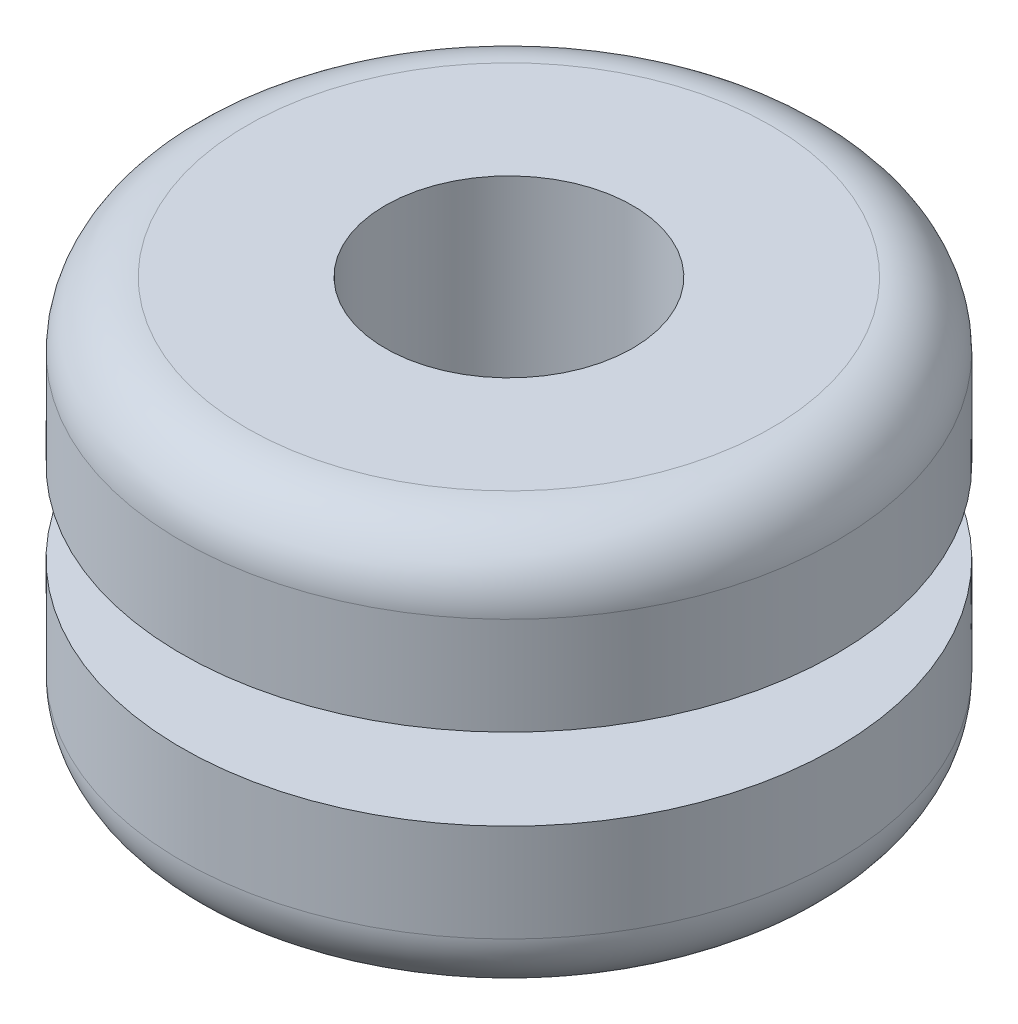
ISO-10303-21;
HEADER;
FILE_DESCRIPTION(('STEP AP214'),'2;1');
FILE_NAME('part.step','',(''),(''),'','','');
FILE_SCHEMA(('AUTOMOTIVE_DESIGN { 1 0 10303 214 1 1 1 1 }'));
ENDSEC;
DATA;
#1=APPLICATION_CONTEXT('core data for automotive mechanical design processes');
#2=APPLICATION_PROTOCOL_DEFINITION('international standard','automotive_design',2000,#1);
#3=PRODUCT_CONTEXT('',#1,'mechanical');
#4=PRODUCT('Part','Part','',(#3));
#5=PRODUCT_RELATED_PRODUCT_CATEGORY('part','',(#4));
#6=PRODUCT_DEFINITION_FORMATION('','',#4);
#7=PRODUCT_DEFINITION_CONTEXT('part definition',#1,'design');
#8=PRODUCT_DEFINITION('design','',#6,#7);
#9=PRODUCT_DEFINITION_SHAPE('','',#8);
#10=(LENGTH_UNIT() NAMED_UNIT(*) SI_UNIT(.MILLI.,.METRE.));
#11=(NAMED_UNIT(*) PLANE_ANGLE_UNIT() SI_UNIT($,.RADIAN.));
#12=(NAMED_UNIT(*) SI_UNIT($,.STERADIAN.) SOLID_ANGLE_UNIT());
#13=UNCERTAINTY_MEASURE_WITH_UNIT(LENGTH_MEASURE(1.E-05),#10,'distance_accuracy_value','');
#14=(GEOMETRIC_REPRESENTATION_CONTEXT(3) GLOBAL_UNCERTAINTY_ASSIGNED_CONTEXT((#13)) GLOBAL_UNIT_ASSIGNED_CONTEXT((#10,
#11,#12)) REPRESENTATION_CONTEXT('',''));
#15=CARTESIAN_POINT('',(0.,0.,0.));
#16=DIRECTION('',(0.,0.,1.));
#17=DIRECTION('',(1.,0.,0.));
#18=AXIS2_PLACEMENT_3D('',#15,#16,#17);
#19=CARTESIAN_POINT('',(0.992428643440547,-30.95625,7.14375));
#20=DIRECTION('',(0.,-1.,0.));
#21=DIRECTION('',(1.,0.,0.));
#22=AXIS2_PLACEMENT_3D('',#19,#20,#21);
#23=CYLINDRICAL_SURFACE('',#22,3.34645);
#24=CARTESIAN_POINT('',(0.992428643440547,-30.1625,7.14375));
#25=DIRECTION('',(0.,-1.,0.));
#26=DIRECTION('',(1.,0.,0.));
#27=AXIS2_PLACEMENT_3D('',#24,#25,#26);
#28=CIRCLE('',#27,3.34645);
#29=CARTESIAN_POINT('',(4.33887864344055,-30.1625,7.14375));
#30=VERTEX_POINT('',#29);
#31=EDGE_CURVE('E16',#30,#30,#28,.F.);
#32=ORIENTED_EDGE('',*,*,#31,.F.);
#33=EDGE_LOOP('',(#32));
#34=FACE_BOUND('',#33,.T.);
#35=CARTESIAN_POINT('',(0.992428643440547,-31.75,7.14375));
#36=DIRECTION('',(0.,-1.,0.));
#37=DIRECTION('',(1.,0.,0.));
#38=AXIS2_PLACEMENT_3D('',#35,#36,#37);
#39=CIRCLE('',#38,3.34645);
#40=CARTESIAN_POINT('',(4.33887864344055,-31.75,7.14375));
#41=VERTEX_POINT('',#40);
#42=EDGE_CURVE('E39',#41,#41,#39,.T.);
#43=ORIENTED_EDGE('',*,*,#42,.F.);
#44=EDGE_LOOP('',(#43));
#45=FACE_BOUND('',#44,.T.);
#46=ADVANCED_FACE('F13',(#34,#45),#23,.T.);
#47=CARTESIAN_POINT('',(0.992428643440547,-30.1625,12.0071321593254));
#48=DIRECTION('',(0.,-1.,0.));
#49=DIRECTION('',(0.,0.,-1.));
#50=AXIS2_PLACEMENT_3D('',#47,#48,#49);
#51=PLANE('',#50);
#52=ORIENTED_EDGE('',*,*,#31,.T.);
#53=EDGE_LOOP('',(#52));
#54=FACE_BOUND('',#53,.T.);
#55=CARTESIAN_POINT('',(0.992428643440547,-30.1625,7.14375));
#56=DIRECTION('',(0.,-1.,0.));
#57=DIRECTION('',(1.,0.,0.));
#58=AXIS2_PLACEMENT_3D('',#55,#56,#57);
#59=CIRCLE('',#58,6.38031431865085);
#60=CARTESIAN_POINT('',(7.37274296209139,-30.1625,7.14375));
#61=VERTEX_POINT('',#60);
#62=EDGE_CURVE('E37',#61,#61,#59,.F.);
#63=ORIENTED_EDGE('',*,*,#62,.F.);
#64=EDGE_LOOP('',(#63));
#65=FACE_BOUND('',#64,.T.);
#66=ADVANCED_FACE('F46',(#54,#65),#51,.T.);
#67=CARTESIAN_POINT('',(0.992428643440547,-31.75,12.0071321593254));
#68=DIRECTION('',(0.,1.,0.));
#69=DIRECTION('',(0.,0.,1.));
#70=AXIS2_PLACEMENT_3D('',#67,#68,#69);
#71=PLANE('',#70);
#72=ORIENTED_EDGE('',*,*,#42,.T.);
#73=EDGE_LOOP('',(#72));
#74=FACE_BOUND('',#73,.T.);
#75=CARTESIAN_POINT('',(0.992428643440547,-31.75,7.14375));
#76=DIRECTION('',(0.,-1.,0.));
#77=DIRECTION('',(1.,0.,0.));
#78=AXIS2_PLACEMENT_3D('',#75,#76,#77);
#79=CIRCLE('',#78,6.38031431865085);
#80=CARTESIAN_POINT('',(7.37274296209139,-31.75,7.14375));
#81=VERTEX_POINT('',#80);
#82=EDGE_CURVE('E33',#81,#81,#79,.T.);
#83=ORIENTED_EDGE('',*,*,#82,.F.);
#84=EDGE_LOOP('',(#83));
#85=FACE_BOUND('',#84,.T.);
#86=ADVANCED_FACE('F55',(#74,#85),#71,.T.);
#87=CARTESIAN_POINT('',(0.992428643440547,-29.21,7.14375));
#88=DIRECTION('',(0.,-1.,0.));
#89=DIRECTION('',(1.,0.,0.));
#90=AXIS2_PLACEMENT_3D('',#87,#88,#89);
#91=CYLINDRICAL_SURFACE('',#90,6.38031431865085);
#92=CARTESIAN_POINT('',(0.992428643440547,-28.2575,7.14375));
#93=DIRECTION('',(0.,-1.,0.));
#94=DIRECTION('',(0.,0.,-1.));
#95=AXIS2_PLACEMENT_3D('',#92,#93,#94);
#96=CIRCLE('',#95,6.38031431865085);
#97=CARTESIAN_POINT('',(0.992428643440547,-28.2575,0.763435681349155));
#98=VERTEX_POINT('',#97);
#99=EDGE_CURVE('E36',#98,#98,#96,.F.);
#100=ORIENTED_EDGE('',*,*,#99,.F.);
#101=EDGE_LOOP('',(#100));
#102=FACE_BOUND('',#101,.T.);
#103=ORIENTED_EDGE('',*,*,#62,.T.);
#104=EDGE_LOOP('',(#103));
#105=FACE_BOUND('',#104,.T.);
#106=ADVANCED_FACE('F130',(#102,#105),#91,.T.);
#107=CARTESIAN_POINT('',(0.992428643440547,-32.7025,7.14375));
#108=DIRECTION('',(0.,-1.,0.));
#109=DIRECTION('',(1.,0.,0.));
#110=AXIS2_PLACEMENT_3D('',#107,#108,#109);
#111=CYLINDRICAL_SURFACE('',#110,6.38031431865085);
#112=ORIENTED_EDGE('',*,*,#82,.T.);
#113=EDGE_LOOP('',(#112));
#114=FACE_BOUND('',#113,.T.);
#115=CARTESIAN_POINT('',(0.992428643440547,-33.655,7.14375));
#116=DIRECTION('',(0.,-1.,0.));
#117=DIRECTION('',(0.,0.,-1.));
#118=AXIS2_PLACEMENT_3D('',#115,#116,#117);
#119=CIRCLE('',#118,6.38031431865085);
#120=CARTESIAN_POINT('',(0.992428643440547,-33.655,0.763435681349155));
#121=VERTEX_POINT('',#120);
#122=EDGE_CURVE('E97',#121,#121,#119,.T.);
#123=ORIENTED_EDGE('',*,*,#122,.F.);
#124=EDGE_LOOP('',(#123));
#125=FACE_BOUND('',#124,.T.);
#126=ADVANCED_FACE('F128',(#114,#125),#111,.T.);
#127=CARTESIAN_POINT('',(0.992428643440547,-28.2575,7.14375));
#128=DIRECTION('',(0.,-1.,0.));
#129=DIRECTION('',(0.,0.,-1.));
#130=AXIS2_PLACEMENT_3D('',#127,#128,#129);
#131=TOROIDAL_SURFACE('',#130,5.11031431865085,1.27);
#132=CARTESIAN_POINT('',(0.992428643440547,-26.9875,7.14375));
#133=DIRECTION('',(0.,-1.,0.));
#134=DIRECTION('',(0.,0.,1.));
#135=AXIS2_PLACEMENT_3D('',#132,#133,#134);
#136=CIRCLE('',#135,5.11031431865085);
#137=CARTESIAN_POINT('',(0.992428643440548,-26.9875,12.2540643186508));
#138=VERTEX_POINT('',#137);
#139=EDGE_CURVE('E86',#138,#138,#136,.F.);
#140=ORIENTED_EDGE('',*,*,#139,.F.);
#141=EDGE_LOOP('',(#140));
#142=FACE_BOUND('',#141,.T.);
#143=ORIENTED_EDGE('',*,*,#99,.T.);
#144=EDGE_LOOP('',(#143));
#145=FACE_BOUND('',#144,.T.);
#146=ADVANCED_FACE('F102',(#142,#145),#131,.T.);
#147=CARTESIAN_POINT('',(0.992428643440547,-33.655,7.14375));
#148=DIRECTION('',(0.,-1.,0.));
#149=DIRECTION('',(0.,0.,-1.));
#150=AXIS2_PLACEMENT_3D('',#147,#148,#149);
#151=TOROIDAL_SURFACE('',#150,5.11031431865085,1.27);
#152=ORIENTED_EDGE('',*,*,#122,.T.);
#153=EDGE_LOOP('',(#152));
#154=FACE_BOUND('',#153,.T.);
#155=CARTESIAN_POINT('',(0.992428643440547,-34.925,7.14375));
#156=DIRECTION('',(0.,1.,0.));
#157=DIRECTION('',(0.,0.,1.));
#158=AXIS2_PLACEMENT_3D('',#155,#156,#157);
#159=CIRCLE('',#158,5.11031431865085);
#160=CARTESIAN_POINT('',(0.992428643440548,-34.925,12.2540643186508));
#161=VERTEX_POINT('',#160);
#162=EDGE_CURVE('E25',#161,#161,#159,.F.);
#163=ORIENTED_EDGE('',*,*,#162,.F.);
#164=EDGE_LOOP('',(#163));
#165=FACE_BOUND('',#164,.T.);
#166=ADVANCED_FACE('F99',(#154,#165),#151,.T.);
#167=CARTESIAN_POINT('',(0.992428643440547,-26.9875,10.9046893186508));
#168=DIRECTION('',(0.,1.,0.));
#169=DIRECTION('',(0.,0.,1.));
#170=AXIS2_PLACEMENT_3D('',#167,#168,#169);
#171=PLANE('',#170);
#172=CARTESIAN_POINT('',(0.992428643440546,-26.9875,7.14375));
#173=DIRECTION('',(0.,-1.,0.));
#174=DIRECTION('',(1.,0.,0.));
#175=AXIS2_PLACEMENT_3D('',#172,#173,#174);
#176=CIRCLE('',#175,2.41156431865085);
#177=CARTESIAN_POINT('',(3.40399296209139,-26.9875,7.14375));
#178=VERTEX_POINT('',#177);
#179=EDGE_CURVE('E20',#178,#178,#176,.T.);
#180=ORIENTED_EDGE('',*,*,#179,.T.);
#181=EDGE_LOOP('',(#180));
#182=FACE_BOUND('',#181,.T.);
#183=ORIENTED_EDGE('',*,*,#139,.T.);
#184=EDGE_LOOP('',(#183));
#185=FACE_BOUND('',#184,.T.);
#186=ADVANCED_FACE('F64',(#182,#185),#171,.T.);
#187=CARTESIAN_POINT('',(0.992428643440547,-34.925,10.9046893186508));
#188=DIRECTION('',(0.,-1.,0.));
#189=DIRECTION('',(0.,0.,-1.));
#190=AXIS2_PLACEMENT_3D('',#187,#188,#189);
#191=PLANE('',#190);
#192=CARTESIAN_POINT('',(0.992428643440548,-34.925,7.14375));
#193=DIRECTION('',(0.,-1.,0.));
#194=DIRECTION('',(1.,0.,0.));
#195=AXIS2_PLACEMENT_3D('',#192,#193,#194);
#196=CIRCLE('',#195,2.41156431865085);
#197=CARTESIAN_POINT('',(3.40399296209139,-34.925,7.14375));
#198=VERTEX_POINT('',#197);
#199=EDGE_CURVE('E9',#198,#198,#196,.F.);
#200=ORIENTED_EDGE('',*,*,#199,.T.);
#201=EDGE_LOOP('',(#200));
#202=FACE_BOUND('',#201,.T.);
#203=ORIENTED_EDGE('',*,*,#162,.T.);
#204=EDGE_LOOP('',(#203));
#205=FACE_BOUND('',#204,.T.);
#206=ADVANCED_FACE('F58',(#202,#205),#191,.T.);
#207=CARTESIAN_POINT('',(0.992428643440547,-30.95625,7.14375));
#208=DIRECTION('',(0.,-1.,0.));
#209=DIRECTION('',(1.,0.,0.));
#210=AXIS2_PLACEMENT_3D('',#207,#208,#209);
#211=CYLINDRICAL_SURFACE('',#210,2.41156431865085);
#212=ORIENTED_EDGE('',*,*,#199,.F.);
#213=EDGE_LOOP('',(#212));
#214=FACE_BOUND('',#213,.T.);
#215=ORIENTED_EDGE('',*,*,#179,.F.);
#216=EDGE_LOOP('',(#215));
#217=FACE_BOUND('',#216,.T.);
#218=ADVANCED_FACE('F56',(#214,#217),#211,.F.);
#219=CLOSED_SHELL('',(#46,#66,#86,#106,#126,#146,#166,#186,#206,#218));
#220=MANIFOLD_SOLID_BREP('B1',#219);
#221=ADVANCED_BREP_SHAPE_REPRESENTATION('',(#18,#220),#14);
#222=SHAPE_DEFINITION_REPRESENTATION(#9,#221);
ENDSEC;
END-ISO-10303-21;
